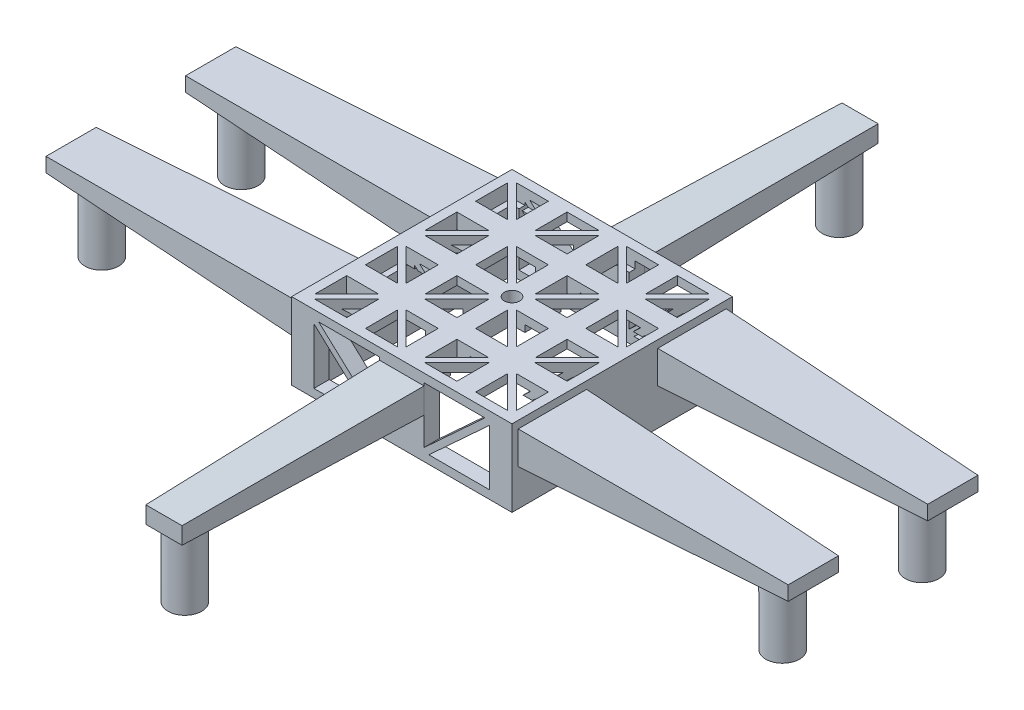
from build123d import *

# Parameters (mm, degrees)
SKETCH1_W                 = 143.57617866
SKETCH1_H                 = 143.57617866
BOSS_EXTRUDE1_DEPTH       = 50
CUT_EXTRUDE1_DEPTH        = 10
SKETCH3_W                 = 123.57617866
SKETCH3_H                 = 123.57617866
CUT_EXTRUDE2_DEPTH        = 40
CUT_EXTRUDE3_DEPTH        = 169.129857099
SKETCH5_R                 = 5
CUT_EXTRUDE4_DEPTH        = 114.16827974
SKETCH6_W                 = 44.617830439
SKETCH6_H                 = 21.235479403
BOSS_EXTRUDE2_DEPTH       = 170
BOSS_EXTRUDE2_TAPER       = 2
SKETCH7_R                 = 11
SKETCH7_R_2               = 9
BOSS_EXTRUDE3_DEPTH       = 50
SKETCH8_R                 = 9
CUT_EXTRUDE5_DEPTH        = 50
MIRROR3_COPY_1_SKETCH_W   = 44.617830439
MIRROR3_COPY_1_SKETCH_H   = 21.235479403
MIRROR3_COPY_1_DEPTH      = 170
MIRROR3_COPY_1_TAPER      = 2
MIRROR3_COPY_2_SKETCH_R   = 11
MIRROR3_COPY_2_SKETCH_R_2 = 9
MIRROR3_COPY_2_DEPTH      = 50
SKETCH9_W                 = 29.00123411
SKETCH9_H                 = 16.460608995
BOSS_EXTRUDE4_DEPTH       = 155
BOSS_EXTRUDE4_TAPER       = 1
SKETCH10_R                = 11
SKETCH10_R_2              = 9
BOSS_EXTRUDE5_DEPTH       = 50
SKETCH11_R                = 9
CUT_EXTRUDE6_DEPTH        = 50


with BuildPart() as part:
    # Sketch1 → Boss-Extrude1 (new body)
    with BuildSketch(Plane(origin=(0, 0, 0), x_dir=(1, 0, 0), z_dir=(0, 1, 0))):
        Rectangle(SKETCH1_W, SKETCH1_H)
    extrude(amount=BOSS_EXTRUDE1_DEPTH)

    # Sketch2 → Cut-Extrude1 (cut)
    with BuildSketch(Plane(origin=(0, 50, 0), x_dir=(1, 0, 0), z_dir=(0, 1, 0))):
        Polygon((-42.001828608, 44.830255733), (-62.851878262, 65.680305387), (-42.001828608, 65.680305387), align=None)
        Polygon((-65.680305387, 42.001828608), (-65.680305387, 62.851878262), (-44.830255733, 42.001828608), align=None)
        Polygon((-29.786260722, 44.830255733), (-29.786260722, 65.680305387), (-8.936211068, 65.680305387), align=None)
        Polygon((-26.957833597, 42.001828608), (-6.107783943, 42.001828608), (-6.107783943, 62.851878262), align=None)
        Polygon((-26.957833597, 29.786260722), (-6.107783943, 8.936211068), (-6.107783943, 29.786260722), align=None)
        Polygon((-29.786260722, 26.957833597), (-8.936211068, 6.107783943), (-29.786260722, 6.107783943), align=None)
        Polygon((-42.001828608, 26.957833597), (-42.001828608, 6.107783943), (-62.851878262, 6.107783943), align=None)
        Polygon((-65.680305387, 29.786260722), (-65.680305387, 8.936211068), (-44.830255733, 29.786260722), align=None)
        Polygon((42.001828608, 44.830255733), (42.001828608, 65.680305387), (62.851878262, 65.680305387), align=None)
        Polygon((44.830255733, 42.001828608), (65.680305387, 62.851878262), (65.680305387, 42.001828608), align=None)
        Polygon((26.957833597, 42.001828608), (6.107783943, 62.851878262), (6.107783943, 42.001828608), align=None)
        Polygon((29.786260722, 44.830255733), (8.936211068, 65.680305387), (29.786260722, 65.680305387), align=None)
        Polygon((44.830255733, 29.786260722), (65.680305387, 29.786260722), (65.680305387, 8.936211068), align=None)
        Polygon((42.001828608, 26.957833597), (62.851878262, 6.107783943), (42.001828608, 6.107783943), align=None)
        Polygon((29.786260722, 26.957833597), (29.786260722, 6.107783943), (8.936211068, 6.107783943), align=None)
        Polygon((26.957833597, 29.786260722), (6.107783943, 29.786260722), (6.107783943, 8.936211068), align=None)
        Polygon((-44.830255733, -42.001828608), (-65.680305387, -62.851878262), (-65.680305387, -42.001828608), align=None)
        Polygon((-42.001828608, -44.830255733), (-42.001828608, -65.680305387), (-62.851878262, -65.680305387), align=None)
        Polygon((-26.957833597, -42.001828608), (-6.107783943, -62.851878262), (-6.107783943, -42.001828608), align=None)
        Polygon((-29.786260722, -44.830255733), (-8.936211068, -65.680305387), (-29.786260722, -65.680305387), align=None)
        Polygon((-44.830255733, -29.786260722), (-65.680305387, -29.786260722), (-65.680305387, -8.936211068), align=None)
        Polygon((-42.001828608, -26.957833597), (-62.851878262, -6.107783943), (-42.001828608, -6.107783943), align=None)
        Polygon((-29.786260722, -26.957833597), (-29.786260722, -6.107783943), (-8.936211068, -6.107783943), align=None)
        Polygon((-26.957833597, -29.786260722), (-6.107783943, -29.786260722), (-6.107783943, -8.936211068), align=None)
        Polygon((26.957833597, -29.786260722), (6.107783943, -8.936211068), (6.107783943, -29.786260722), align=None)
        Polygon((29.786260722, -26.957833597), (8.936211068, -6.107783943), (29.786260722, -6.107783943), align=None)
        Polygon((42.001828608, -26.957833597), (42.001828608, -6.107783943), (62.851878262, -6.107783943), align=None)
        Polygon((65.680305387, -29.786260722), (65.680305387, -8.936211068), (44.830255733, -29.786260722), align=None)
        Polygon((29.786260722, -44.830255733), (29.786260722, -65.680305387), (8.936211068, -65.680305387), align=None)
        Polygon((26.957833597, -42.001828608), (6.107783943, -42.001828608), (6.107783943, -62.851878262), align=None)
        Polygon((44.830255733, -42.001828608), (65.680305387, -42.001828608), (65.680305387, -62.851878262), align=None)
        Polygon((42.001828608, -44.830255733), (62.851878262, -65.680305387), (42.001828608, -65.680305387), align=None)
    extrude(amount=-CUT_EXTRUDE1_DEPTH, mode=Mode.SUBTRACT)

    # Sketch3 → Cut-Extrude2 (cut)
    with BuildSketch(Plane.XZ):
        Rectangle(SKETCH3_W, SKETCH3_H)
    extrude(amount=-CUT_EXTRUDE2_DEPTH, mode=Mode.SUBTRACT)

    # Sketch4 → Cut-Extrude3 (cut, through all)
    with BuildSketch(Plane(origin=(0, 0, -71.78808933), x_dir=(-1, 0, 0), z_dir=(0, 0, -1))):
        Polygon((-14.500617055, 8.018392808), (-54.163133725, 44.542149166), (-14.500617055, 44.542149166), align=None)
        Polygon((-17.624955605, 5.457850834), (-57.287472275, 41.981607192), (-57.287472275, 5.457850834), align=None)
        Polygon((14.500617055, 8.018392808), (14.500617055, 44.542149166), (54.163133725, 44.542149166), align=None)
        Polygon((17.624955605, 5.457850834), (57.287472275, 5.457850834), (57.287472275, 41.981607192), align=None)
    extrude(amount=-CUT_EXTRUDE3_DEPTH, mode=Mode.SUBTRACT)

    # Sketch5 → Cut-Extrude4 (cut, through all)
    with BuildSketch(Plane(origin=(0, 50, 0), x_dir=(1, 0, 0), z_dir=(0, 1, 0))):
        with Locations(Location((0, 0, 0), (0, 0, 270))):
            Circle(SKETCH5_R)
    extrude(amount=-CUT_EXTRUDE4_DEPTH, mode=Mode.SUBTRACT)

    # Sketch6 → Boss-Extrude2 (add)
    with BuildSketch(Plane(origin=(71.78808933, 0, 0), x_dir=(0, 0, -1), z_dir=(1, 0, 0))):
        with Locations((-45.464952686, 34.510575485)):
            Rectangle(SKETCH6_W, SKETCH6_H)
    boss_extrude2 = extrude(amount=BOSS_EXTRUDE2_DEPTH, taper=BOSS_EXTRUDE2_TAPER)

    # Sketch7 → Boss-Extrude3 (add)
    with BuildSketch(Plane(origin=(0, 34.510575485, 0), x_dir=(1, 0, 0), z_dir=(0, 1, 0))):
        with Locations(Location((221.78808933, -45.464952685, 0), (0, 0, 270))):
            Circle(SKETCH7_R)
        with Locations(Location((221.78808933, -45.464952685, 0), (0, 0, 270))):
            Circle(SKETCH7_R_2, mode=Mode.SUBTRACT)
    boss_extrude3 = extrude(amount=-BOSS_EXTRUDE3_DEPTH)

    # Sketch8 → Cut-Extrude5 (cut)
    with BuildSketch(Plane(origin=(0, 34.510575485, 0), x_dir=(1, 0, 0), z_dir=(0, 1, 0))):
        with Locations(Location((221.78808933, -45.464952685, 0), (0, 0, 270))):
            Circle(SKETCH8_R)
    extrude(amount=-CUT_EXTRUDE5_DEPTH, mode=Mode.SUBTRACT)

    # Mirror2: Boss-Extrude2, Boss-Extrude3 across plane
    add(boss_extrude2.mirror(Plane.XY))
    add(boss_extrude3.mirror(Plane.XY))

    # Mirror3: Boss-Extrude2, Boss-Extrude3 across plane
    add(boss_extrude2.mirror(Plane(origin=(0, 0, 0), x_dir=(0, 0, 1), z_dir=(1, 0, 0))))
    add(boss_extrude3.mirror(Plane(origin=(0, 0, 0), x_dir=(0, 0, 1), z_dir=(1, 0, 0))))

    # Mirror3 copy 1 sketch → Mirror3 copy 1 (add)
    with BuildSketch(Plane.ZY.offset(71.78808933)):
        with Locations((-45.464952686, 34.510575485)):
            Rectangle(MIRROR3_COPY_1_SKETCH_W, MIRROR3_COPY_1_SKETCH_H)
    extrude(amount=MIRROR3_COPY_1_DEPTH, taper=MIRROR3_COPY_1_TAPER)

    # Mirror3 copy 2 sketch → Mirror3 copy 2 (add)
    with BuildSketch(Plane(origin=(0, 34.510575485, 0), x_dir=(-1, 0, 0), z_dir=(0, 1, 0))):
        with Locations(Location((221.78808933, -45.464952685, 0), (0, 0, 270))):
            Circle(MIRROR3_COPY_2_SKETCH_R)
        with Locations(Location((221.78808933, -45.464952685, 0), (0, 0, 270))):
            Circle(MIRROR3_COPY_2_SKETCH_R_2, mode=Mode.SUBTRACT)
    extrude(amount=-MIRROR3_COPY_2_DEPTH)

    # Sketch9 → Boss-Extrude4 (add)
    with BuildSketch(Plane(origin=(0, 0, -71.78808933), x_dir=(-1, 0, 0), z_dir=(0, 0, -1))):
        with Locations((0, 34.510575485)):
            Rectangle(SKETCH9_W, SKETCH9_H)
    boss_extrude4 = extrude(amount=BOSS_EXTRUDE4_DEPTH, taper=BOSS_EXTRUDE4_TAPER)

    # Sketch10 → Boss-Extrude5 (add)
    with BuildSketch(Plane(origin=(0, 34.510575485, 0), x_dir=(1, 0, 0), z_dir=(0, 1, 0))):
        with Locations(Location((0, 213.165360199, 0), (0, 0, 270))):
            Circle(SKETCH10_R)
        with Locations(Location((0, 213.165360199, 0), (0, 0, 270))):
            Circle(SKETCH10_R_2, mode=Mode.SUBTRACT)
    boss_extrude5 = extrude(amount=-BOSS_EXTRUDE5_DEPTH)

    # Sketch11 → Cut-Extrude6 (cut)
    with BuildSketch(Plane(origin=(0, 34.510575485, 0), x_dir=(1, 0, 0), z_dir=(0, 1, 0))):
        with Locations(Location((0, 213.165360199, 0), (0, 0, 270))):
            Circle(SKETCH11_R)
    extrude(amount=-CUT_EXTRUDE6_DEPTH, mode=Mode.SUBTRACT)

    # Mirror4: Boss-Extrude4, Boss-Extrude5 across plane
    add(boss_extrude4.mirror(Plane.XY))
    add(boss_extrude5.mirror(Plane.XY))


solid = part.part
